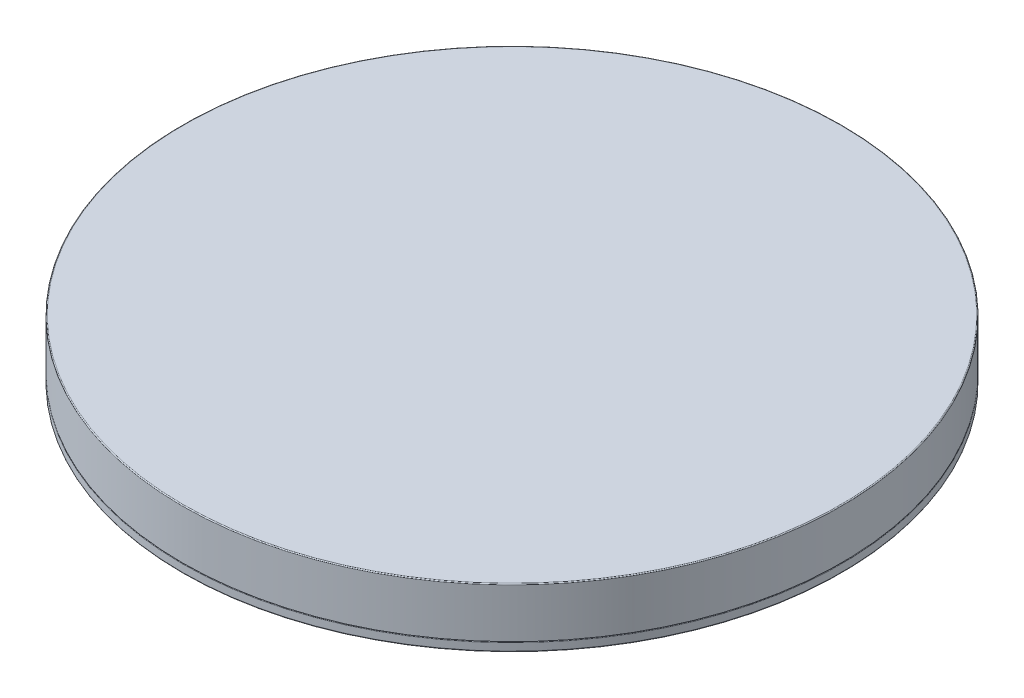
ISO-10303-21;
HEADER;
FILE_DESCRIPTION(('STEP AP214'),'2;1');
FILE_NAME('part.step','',(''),(''),'','','');
FILE_SCHEMA(('AUTOMOTIVE_DESIGN { 1 0 10303 214 1 1 1 1 }'));
ENDSEC;
DATA;
#1=APPLICATION_CONTEXT('core data for automotive mechanical design processes');
#2=APPLICATION_PROTOCOL_DEFINITION('international standard','automotive_design',2000,#1);
#3=PRODUCT_CONTEXT('',#1,'mechanical');
#4=PRODUCT('Part','Part','',(#3));
#5=PRODUCT_RELATED_PRODUCT_CATEGORY('part','',(#4));
#6=PRODUCT_DEFINITION_FORMATION('','',#4);
#7=PRODUCT_DEFINITION_CONTEXT('part definition',#1,'design');
#8=PRODUCT_DEFINITION('design','',#6,#7);
#9=PRODUCT_DEFINITION_SHAPE('','',#8);
#10=(LENGTH_UNIT() NAMED_UNIT(*) SI_UNIT(.MILLI.,.METRE.));
#11=(NAMED_UNIT(*) PLANE_ANGLE_UNIT() SI_UNIT($,.RADIAN.));
#12=(NAMED_UNIT(*) SI_UNIT($,.STERADIAN.) SOLID_ANGLE_UNIT());
#13=UNCERTAINTY_MEASURE_WITH_UNIT(LENGTH_MEASURE(1.E-05),#10,'distance_accuracy_value','');
#14=(GEOMETRIC_REPRESENTATION_CONTEXT(3) GLOBAL_UNCERTAINTY_ASSIGNED_CONTEXT((#13)) GLOBAL_UNIT_ASSIGNED_CONTEXT((#10,
#11,#12)) REPRESENTATION_CONTEXT('',''));
#15=CARTESIAN_POINT('',(0.,0.,0.));
#16=DIRECTION('',(0.,0.,1.));
#17=DIRECTION('',(1.,0.,0.));
#18=AXIS2_PLACEMENT_3D('',#15,#16,#17);
#19=CARTESIAN_POINT('',(0.,13.,0.));
#20=DIRECTION('',(0.,-1.,0.));
#21=DIRECTION('',(0.,0.,-1.));
#22=AXIS2_PLACEMENT_3D('',#19,#20,#21);
#23=CYLINDRICAL_SURFACE('',#22,72.5);
#24=CARTESIAN_POINT('',(0.,12.8,0.));
#25=DIRECTION('',(0.,1.,0.));
#26=DIRECTION('',(0.,0.,1.));
#27=AXIS2_PLACEMENT_3D('',#24,#25,#26);
#28=CIRCLE('',#27,72.5);
#29=CARTESIAN_POINT('',(0.,12.8,72.5));
#30=VERTEX_POINT('',#29);
#31=EDGE_CURVE('E11',#30,#30,#28,.F.);
#32=ORIENTED_EDGE('',*,*,#31,.T.);
#33=EDGE_LOOP('',(#32));
#34=FACE_BOUND('',#33,.T.);
#35=CARTESIAN_POINT('',(0.,2.,0.));
#36=DIRECTION('',(0.,1.,0.));
#37=DIRECTION('',(0.,0.,1.));
#38=AXIS2_PLACEMENT_3D('',#35,#36,#37);
#39=CIRCLE('',#38,72.5);
#40=CARTESIAN_POINT('',(0.,2.,72.5));
#41=VERTEX_POINT('',#40);
#42=EDGE_CURVE('E61',#41,#41,#39,.T.);
#43=ORIENTED_EDGE('',*,*,#42,.T.);
#44=EDGE_LOOP('',(#43));
#45=FACE_BOUND('',#44,.T.);
#46=ADVANCED_FACE('F48',(#34,#45),#23,.T.);
#47=CARTESIAN_POINT('',(0.,13.,0.));
#48=DIRECTION('',(0.,1.,0.));
#49=DIRECTION('',(0.,0.,1.));
#50=AXIS2_PLACEMENT_3D('',#47,#48,#49);
#51=PLANE('',#50);
#52=CARTESIAN_POINT('',(0.,13.,0.));
#53=DIRECTION('',(0.,1.,0.));
#54=DIRECTION('',(0.,0.,1.));
#55=AXIS2_PLACEMENT_3D('',#52,#53,#54);
#56=CIRCLE('',#55,72.3);
#57=CARTESIAN_POINT('',(0.,13.,72.3));
#58=VERTEX_POINT('',#57);
#59=EDGE_CURVE('E56',#58,#58,#56,.T.);
#60=ORIENTED_EDGE('',*,*,#59,.T.);
#61=EDGE_LOOP('',(#60));
#62=FACE_BOUND('',#61,.T.);
#63=ADVANCED_FACE('F72',(#62),#51,.T.);
#64=CARTESIAN_POINT('',(0.,2.,0.));
#65=DIRECTION('',(0.,1.,0.));
#66=DIRECTION('',(0.,0.,1.));
#67=AXIS2_PLACEMENT_3D('',#64,#65,#66);
#68=PLANE('',#67);
#69=ORIENTED_EDGE('',*,*,#42,.F.);
#70=EDGE_LOOP('',(#69));
#71=FACE_BOUND('',#70,.T.);
#72=ADVANCED_FACE('F70',(#71),#68,.F.);
#73=CARTESIAN_POINT('',(0.,12.8,0.));
#74=DIRECTION('',(0.,1.,0.));
#75=DIRECTION('',(0.,0.,1.));
#76=AXIS2_PLACEMENT_3D('',#73,#74,#75);
#77=TOROIDAL_SURFACE('',#76,72.3,0.2);
#78=ORIENTED_EDGE('',*,*,#31,.F.);
#79=EDGE_LOOP('',(#78));
#80=FACE_BOUND('',#79,.T.);
#81=ORIENTED_EDGE('',*,*,#59,.F.);
#82=EDGE_LOOP('',(#81));
#83=FACE_BOUND('',#82,.T.);
#84=ADVANCED_FACE('F50',(#80,#83),#77,.T.);
#85=CLOSED_SHELL('',(#46,#63,#72,#84));
#86=MANIFOLD_SOLID_BREP('B2',#85);
#87=CARTESIAN_POINT('',(0.,2.,0.));
#88=DIRECTION('',(0.,-1.,0.));
#89=DIRECTION('',(0.,0.,-1.));
#90=AXIS2_PLACEMENT_3D('',#87,#88,#89);
#91=CYLINDRICAL_SURFACE('',#90,72.5);
#92=CARTESIAN_POINT('',(0.,0.2,0.));
#93=DIRECTION('',(0.,1.,0.));
#94=DIRECTION('',(0.,0.,1.));
#95=AXIS2_PLACEMENT_3D('',#92,#93,#94);
#96=CIRCLE('',#95,72.5);
#97=CARTESIAN_POINT('',(0.,0.2,72.5));
#98=VERTEX_POINT('',#97);
#99=EDGE_CURVE('E141',#98,#98,#96,.T.);
#100=ORIENTED_EDGE('',*,*,#99,.T.);
#101=EDGE_LOOP('',(#100));
#102=FACE_BOUND('',#101,.T.);
#103=CARTESIAN_POINT('',(0.,1.8,0.));
#104=DIRECTION('',(0.,1.,0.));
#105=DIRECTION('',(0.,0.,1.));
#106=AXIS2_PLACEMENT_3D('',#103,#104,#105);
#107=CIRCLE('',#106,72.5);
#108=CARTESIAN_POINT('',(0.,1.8,72.5));
#109=VERTEX_POINT('',#108);
#110=EDGE_CURVE('E144',#109,#109,#107,.F.);
#111=ORIENTED_EDGE('',*,*,#110,.T.);
#112=EDGE_LOOP('',(#111));
#113=FACE_BOUND('',#112,.T.);
#114=ADVANCED_FACE('F109',(#102,#113),#91,.T.);
#115=CARTESIAN_POINT('',(0.,2.,0.));
#116=DIRECTION('',(0.,1.,0.));
#117=DIRECTION('',(0.,0.,1.));
#118=AXIS2_PLACEMENT_3D('',#115,#116,#117);
#119=PLANE('',#118);
#120=CARTESIAN_POINT('',(0.,2.,0.));
#121=DIRECTION('',(0.,1.,0.));
#122=DIRECTION('',(0.,0.,1.));
#123=AXIS2_PLACEMENT_3D('',#120,#121,#122);
#124=CIRCLE('',#123,72.3);
#125=CARTESIAN_POINT('',(0.,2.,72.3));
#126=VERTEX_POINT('',#125);
#127=EDGE_CURVE('E135',#126,#126,#124,.T.);
#128=ORIENTED_EDGE('',*,*,#127,.T.);
#129=EDGE_LOOP('',(#128));
#130=FACE_BOUND('',#129,.T.);
#131=ADVANCED_FACE('F171',(#130),#119,.T.);
#132=CARTESIAN_POINT('',(0.,0.,0.));
#133=DIRECTION('',(0.,1.,0.));
#134=DIRECTION('',(0.,0.,1.));
#135=AXIS2_PLACEMENT_3D('',#132,#133,#134);
#136=PLANE('',#135);
#137=CARTESIAN_POINT('',(0.,0.,0.));
#138=DIRECTION('',(0.,1.,0.));
#139=DIRECTION('',(0.,0.,1.));
#140=AXIS2_PLACEMENT_3D('',#137,#138,#139);
#141=CIRCLE('',#140,11.2);
#142=CARTESIAN_POINT('',(0.,0.,11.2));
#143=VERTEX_POINT('',#142);
#144=EDGE_CURVE('E124',#143,#143,#141,.T.);
#145=ORIENTED_EDGE('',*,*,#144,.T.);
#146=EDGE_LOOP('',(#145));
#147=FACE_BOUND('',#146,.T.);
#148=CARTESIAN_POINT('',(0.,0.,0.));
#149=DIRECTION('',(0.,1.,0.));
#150=DIRECTION('',(0.,0.,1.));
#151=AXIS2_PLACEMENT_3D('',#148,#149,#150);
#152=CIRCLE('',#151,72.3);
#153=CARTESIAN_POINT('',(0.,0.,72.3));
#154=VERTEX_POINT('',#153);
#155=EDGE_CURVE('E138',#154,#154,#152,.F.);
#156=ORIENTED_EDGE('',*,*,#155,.T.);
#157=EDGE_LOOP('',(#156));
#158=FACE_BOUND('',#157,.T.);
#159=ADVANCED_FACE('F177',(#147,#158),#136,.F.);
#160=CARTESIAN_POINT('',(0.,0.2,0.));
#161=DIRECTION('',(0.,1.,0.));
#162=DIRECTION('',(0.,0.,1.));
#163=AXIS2_PLACEMENT_3D('',#160,#161,#162);
#164=TOROIDAL_SURFACE('',#163,72.3,0.2);
#165=ORIENTED_EDGE('',*,*,#155,.F.);
#166=EDGE_LOOP('',(#165));
#167=FACE_BOUND('',#166,.T.);
#168=ORIENTED_EDGE('',*,*,#99,.F.);
#169=EDGE_LOOP('',(#168));
#170=FACE_BOUND('',#169,.T.);
#171=ADVANCED_FACE('F166',(#167,#170),#164,.T.);
#172=CARTESIAN_POINT('',(0.,1.8,0.));
#173=DIRECTION('',(0.,1.,0.));
#174=DIRECTION('',(0.,0.,1.));
#175=AXIS2_PLACEMENT_3D('',#172,#173,#174);
#176=TOROIDAL_SURFACE('',#175,72.3,0.2);
#177=ORIENTED_EDGE('',*,*,#110,.F.);
#178=EDGE_LOOP('',(#177));
#179=FACE_BOUND('',#178,.T.);
#180=ORIENTED_EDGE('',*,*,#127,.F.);
#181=EDGE_LOOP('',(#180));
#182=FACE_BOUND('',#181,.T.);
#183=ADVANCED_FACE('F156',(#179,#182),#176,.T.);
#184=CARTESIAN_POINT('',(0.,-4.,0.));
#185=DIRECTION('',(0.,1.,0.));
#186=DIRECTION('',(0.,0.,1.));
#187=AXIS2_PLACEMENT_3D('',#184,#185,#186);
#188=CYLINDRICAL_SURFACE('',#187,7.5);
#189=CARTESIAN_POINT('',(0.,-3.8,0.));
#190=DIRECTION('',(0.,-1.,0.));
#191=DIRECTION('',(0.,0.,-1.));
#192=AXIS2_PLACEMENT_3D('',#189,#190,#191);
#193=CIRCLE('',#192,7.5);
#194=CARTESIAN_POINT('',(0.,-3.8,-7.5));
#195=VERTEX_POINT('',#194);
#196=EDGE_CURVE('E120',#195,#195,#193,.T.);
#197=ORIENTED_EDGE('',*,*,#196,.T.);
#198=EDGE_LOOP('',(#197));
#199=FACE_BOUND('',#198,.T.);
#200=CARTESIAN_POINT('',(0.,0.,0.));
#201=DIRECTION('',(0.,-1.,0.));
#202=DIRECTION('',(0.,0.,-1.));
#203=AXIS2_PLACEMENT_3D('',#200,#201,#202);
#204=CIRCLE('',#203,7.5);
#205=CARTESIAN_POINT('',(0.,0.,-7.5));
#206=VERTEX_POINT('',#205);
#207=EDGE_CURVE('E147',#206,#206,#204,.T.);
#208=ORIENTED_EDGE('',*,*,#207,.F.);
#209=EDGE_LOOP('',(#208));
#210=FACE_BOUND('',#209,.T.);
#211=ADVANCED_FACE('F153',(#199,#210),#188,.F.);
#212=CARTESIAN_POINT('',(0.,-4.,0.));
#213=DIRECTION('',(0.,1.,0.));
#214=DIRECTION('',(0.,0.,1.));
#215=AXIS2_PLACEMENT_3D('',#212,#213,#214);
#216=CYLINDRICAL_SURFACE('',#215,11.);
#217=CARTESIAN_POINT('',(0.,-0.2,0.));
#218=DIRECTION('',(0.,1.,0.));
#219=DIRECTION('',(0.,0.,1.));
#220=AXIS2_PLACEMENT_3D('',#217,#218,#219);
#221=CIRCLE('',#220,11.);
#222=CARTESIAN_POINT('',(0.,-0.2,11.));
#223=VERTEX_POINT('',#222);
#224=EDGE_CURVE('E129',#223,#223,#221,.F.);
#225=ORIENTED_EDGE('',*,*,#224,.T.);
#226=EDGE_LOOP('',(#225));
#227=FACE_BOUND('',#226,.T.);
#228=CARTESIAN_POINT('',(0.,-3.8,0.));
#229=DIRECTION('',(0.,-1.,0.));
#230=DIRECTION('',(0.,0.,-1.));
#231=AXIS2_PLACEMENT_3D('',#228,#229,#230);
#232=CIRCLE('',#231,11.);
#233=CARTESIAN_POINT('',(0.,-3.8,-11.));
#234=VERTEX_POINT('',#233);
#235=EDGE_CURVE('E132',#234,#234,#232,.F.);
#236=ORIENTED_EDGE('',*,*,#235,.T.);
#237=EDGE_LOOP('',(#236));
#238=FACE_BOUND('',#237,.T.);
#239=ADVANCED_FACE('F155',(#227,#238),#216,.T.);
#240=CARTESIAN_POINT('',(0.,-4.,0.));
#241=DIRECTION('',(0.,-1.,0.));
#242=DIRECTION('',(0.,0.,-1.));
#243=AXIS2_PLACEMENT_3D('',#240,#241,#242);
#244=PLANE('',#243);
#245=CARTESIAN_POINT('',(0.,-4.,0.));
#246=DIRECTION('',(0.,-1.,0.));
#247=DIRECTION('',(0.,0.,-1.));
#248=AXIS2_PLACEMENT_3D('',#245,#246,#247);
#249=CIRCLE('',#248,7.7);
#250=CARTESIAN_POINT('',(0.,-4.,-7.7));
#251=VERTEX_POINT('',#250);
#252=EDGE_CURVE('E47',#251,#251,#249,.F.);
#253=ORIENTED_EDGE('',*,*,#252,.T.);
#254=EDGE_LOOP('',(#253));
#255=FACE_BOUND('',#254,.T.);
#256=CARTESIAN_POINT('',(0.,-4.,0.));
#257=DIRECTION('',(0.,-1.,0.));
#258=DIRECTION('',(0.,0.,-1.));
#259=AXIS2_PLACEMENT_3D('',#256,#257,#258);
#260=CIRCLE('',#259,10.8);
#261=CARTESIAN_POINT('',(0.,-4.,-10.8));
#262=VERTEX_POINT('',#261);
#263=EDGE_CURVE('E116',#262,#262,#260,.T.);
#264=ORIENTED_EDGE('',*,*,#263,.T.);
#265=EDGE_LOOP('',(#264));
#266=FACE_BOUND('',#265,.T.);
#267=ADVANCED_FACE('F163',(#255,#266),#244,.T.);
#268=ORIENTED_EDGE('',*,*,#207,.T.);
#269=EDGE_LOOP('',(#268));
#270=FACE_BOUND('',#269,.T.);
#271=ADVANCED_FACE('F151',(#270),#136,.F.);
#272=CARTESIAN_POINT('',(0.,-0.2,0.));
#273=DIRECTION('',(0.,1.,0.));
#274=DIRECTION('',(0.,0.,1.));
#275=AXIS2_PLACEMENT_3D('',#272,#273,#274);
#276=TOROIDAL_SURFACE('',#275,11.2,0.2);
#277=ORIENTED_EDGE('',*,*,#144,.F.);
#278=EDGE_LOOP('',(#277));
#279=FACE_BOUND('',#278,.T.);
#280=ORIENTED_EDGE('',*,*,#224,.F.);
#281=EDGE_LOOP('',(#280));
#282=FACE_BOUND('',#281,.T.);
#283=ADVANCED_FACE('F185',(#279,#282),#276,.F.);
#284=CARTESIAN_POINT('',(0.,-3.8,0.));
#285=DIRECTION('',(0.,-1.,0.));
#286=DIRECTION('',(0.,0.,-1.));
#287=AXIS2_PLACEMENT_3D('',#284,#285,#286);
#288=TOROIDAL_SURFACE('',#287,7.7,0.2);
#289=ORIENTED_EDGE('',*,*,#252,.F.);
#290=EDGE_LOOP('',(#289));
#291=FACE_BOUND('',#290,.T.);
#292=ORIENTED_EDGE('',*,*,#196,.F.);
#293=EDGE_LOOP('',(#292));
#294=FACE_BOUND('',#293,.T.);
#295=ADVANCED_FACE('F187',(#291,#294),#288,.T.);
#296=CARTESIAN_POINT('',(0.,-3.8,0.));
#297=DIRECTION('',(0.,-1.,0.));
#298=DIRECTION('',(0.,0.,-1.));
#299=AXIS2_PLACEMENT_3D('',#296,#297,#298);
#300=TOROIDAL_SURFACE('',#299,10.8,0.2);
#301=ORIENTED_EDGE('',*,*,#235,.F.);
#302=EDGE_LOOP('',(#301));
#303=FACE_BOUND('',#302,.T.);
#304=ORIENTED_EDGE('',*,*,#263,.F.);
#305=EDGE_LOOP('',(#304));
#306=FACE_BOUND('',#305,.T.);
#307=ADVANCED_FACE('F111',(#303,#306),#300,.T.);
#308=CLOSED_SHELL('',(#114,#131,#159,#171,#183,#211,#239,#267,#271,#283,#295,#307));
#309=MANIFOLD_SOLID_BREP('B6',#308);
#310=ADVANCED_BREP_SHAPE_REPRESENTATION('',(#18,#86,#309),#14);
#311=SHAPE_DEFINITION_REPRESENTATION(#9,#310);
ENDSEC;
END-ISO-10303-21;
